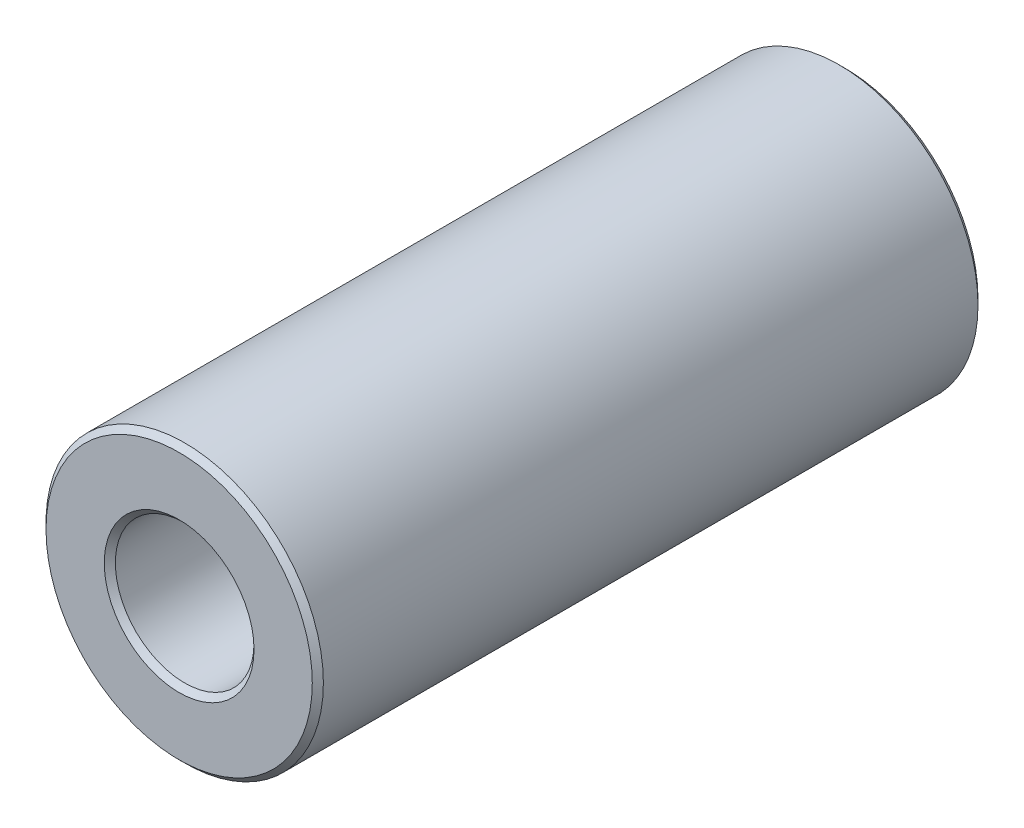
from build123d import *

# Parameters (mm, degrees)
SKETCH1_R           = 2.5
SKETCH1_R_2         = 1.25
BOSS_EXTRUDE2_DEPTH = 6
CHAMFER3_SIZE       = 0.1


with BuildPart() as part:
    # Sketch1 → Boss-Extrude2 (new, symmetric)
    with BuildSketch(Plane.XY):
        Circle(SKETCH1_R)
        Circle(SKETCH1_R_2, mode=Mode.SUBTRACT)
    extrude(amount=BOSS_EXTRUDE2_DEPTH, both=True)

    # Chamfer3
    chamfer3_edges = [part.edges().sort_by_distance(p)[0] for p in [
        (-2.5, 0, -6),
        (-2.5, 0, 6),
        (-1.25, 0, -6),
        (-1.25, 0, 6),
    ]]
    chamfer(chamfer3_edges, length=CHAMFER3_SIZE)


solid = part.part
